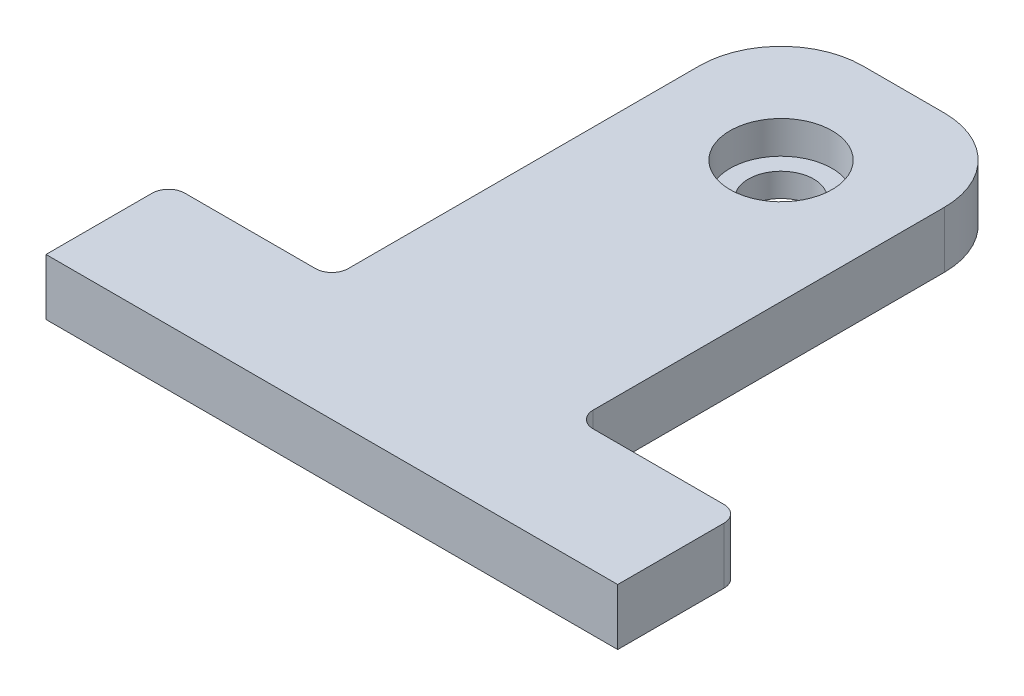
ISO-10303-21;
HEADER;
FILE_DESCRIPTION(('STEP AP214'),'2;1');
FILE_NAME('part.step','',(''),(''),'','','');
FILE_SCHEMA(('AUTOMOTIVE_DESIGN { 1 0 10303 214 1 1 1 1 }'));
ENDSEC;
DATA;
#1=APPLICATION_CONTEXT('core data for automotive mechanical design processes');
#2=APPLICATION_PROTOCOL_DEFINITION('international standard','automotive_design',2000,#1);
#3=PRODUCT_CONTEXT('',#1,'mechanical');
#4=PRODUCT('Part','Part','',(#3));
#5=PRODUCT_RELATED_PRODUCT_CATEGORY('part','',(#4));
#6=PRODUCT_DEFINITION_FORMATION('','',#4);
#7=PRODUCT_DEFINITION_CONTEXT('part definition',#1,'design');
#8=PRODUCT_DEFINITION('design','',#6,#7);
#9=PRODUCT_DEFINITION_SHAPE('','',#8);
#10=(LENGTH_UNIT() NAMED_UNIT(*) SI_UNIT(.MILLI.,.METRE.));
#11=(NAMED_UNIT(*) PLANE_ANGLE_UNIT() SI_UNIT($,.RADIAN.));
#12=(NAMED_UNIT(*) SI_UNIT($,.STERADIAN.) SOLID_ANGLE_UNIT());
#13=UNCERTAINTY_MEASURE_WITH_UNIT(LENGTH_MEASURE(1.E-05),#10,'distance_accuracy_value','');
#14=(GEOMETRIC_REPRESENTATION_CONTEXT(3) GLOBAL_UNCERTAINTY_ASSIGNED_CONTEXT((#13)) GLOBAL_UNIT_ASSIGNED_CONTEXT((#10,
#11,#12)) REPRESENTATION_CONTEXT('',''));
#15=CARTESIAN_POINT('',(0.,0.,0.));
#16=DIRECTION('',(0.,0.,1.));
#17=DIRECTION('',(1.,0.,0.));
#18=AXIS2_PLACEMENT_3D('',#15,#16,#17);
#19=CARTESIAN_POINT('',(44.45,8.763,-69.85));
#20=DIRECTION('',(0.,-1.,0.));
#21=DIRECTION('',(0.,0.,-1.));
#22=AXIS2_PLACEMENT_3D('',#19,#20,#21);
#23=CYLINDRICAL_SURFACE('',#22,5.08000000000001);
#24=CARTESIAN_POINT('',(44.45,0.,-69.85));
#25=DIRECTION('',(0.,1.,0.));
#26=DIRECTION('',(0.,0.,1.));
#27=AXIS2_PLACEMENT_3D('',#24,#25,#26);
#28=CIRCLE('',#27,5.08000000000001);
#29=CARTESIAN_POINT('',(44.45,0.,-64.77));
#30=VERTEX_POINT('',#29);
#31=EDGE_CURVE('E170',#30,#30,#28,.T.);
#32=ORIENTED_EDGE('',*,*,#31,.F.);
#33=EDGE_LOOP('',(#32));
#34=FACE_BOUND('',#33,.T.);
#35=CARTESIAN_POINT('',(44.45,3.683,-69.85));
#36=DIRECTION('',(0.,1.,0.));
#37=DIRECTION('',(0.,0.,1.));
#38=AXIS2_PLACEMENT_3D('',#35,#36,#37);
#39=CIRCLE('',#38,5.08000000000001);
#40=CARTESIAN_POINT('',(44.45,3.683,-64.77));
#41=VERTEX_POINT('',#40);
#42=EDGE_CURVE('E36',#41,#41,#39,.T.);
#43=ORIENTED_EDGE('',*,*,#42,.T.);
#44=EDGE_LOOP('',(#43));
#45=FACE_BOUND('',#44,.T.);
#46=ADVANCED_FACE('F32',(#34,#45),#23,.F.);
#47=CARTESIAN_POINT('',(86.36,8.763,-16.51));
#48=DIRECTION('',(0.,1.,0.));
#49=DIRECTION('',(0.,0.,1.));
#50=AXIS2_PLACEMENT_3D('',#47,#48,#49);
#51=PLANE('',#50);
#52=CARTESIAN_POINT('',(44.45,8.763,-69.85));
#53=DIRECTION('',(0.,1.,0.));
#54=DIRECTION('',(0.,0.,1.));
#55=AXIS2_PLACEMENT_3D('',#52,#53,#54);
#56=CIRCLE('',#55,7.9375);
#57=CARTESIAN_POINT('',(44.45,8.763,-61.9125));
#58=VERTEX_POINT('',#57);
#59=EDGE_CURVE('E381',#58,#58,#56,.T.);
#60=ORIENTED_EDGE('',*,*,#59,.F.);
#61=EDGE_LOOP('',(#60));
#62=FACE_BOUND('',#61,.T.);
#63=DIRECTION('',(0.,0.,1.));
#64=VECTOR('',#63,1.);
#65=CARTESIAN_POINT('',(0.,8.763,-16.51));
#66=LINE('',#65,#64);
#67=CARTESIAN_POINT('',(0.,8.763,-16.51));
#68=VERTEX_POINT('',#67);
#69=CARTESIAN_POINT('',(0.,8.763,0.));
#70=VERTEX_POINT('',#69);
#71=EDGE_CURVE('E193',#68,#70,#66,.T.);
#72=ORIENTED_EDGE('',*,*,#71,.T.);
#73=DIRECTION('',(1.,0.,0.));
#74=VECTOR('',#73,1.);
#75=CARTESIAN_POINT('',(0.,8.763,0.));
#76=LINE('',#75,#74);
#77=CARTESIAN_POINT('',(88.9,8.763,0.));
#78=VERTEX_POINT('',#77);
#79=EDGE_CURVE('E111',#70,#78,#76,.T.);
#80=ORIENTED_EDGE('',*,*,#79,.T.);
#81=DIRECTION('',(0.,0.,-1.));
#82=VECTOR('',#81,1.);
#83=CARTESIAN_POINT('',(88.9,8.763,0.));
#84=LINE('',#83,#82);
#85=CARTESIAN_POINT('',(88.9,8.763,-16.51));
#86=VERTEX_POINT('',#85);
#87=EDGE_CURVE('E227',#78,#86,#84,.T.);
#88=ORIENTED_EDGE('',*,*,#87,.T.);
#89=CARTESIAN_POINT('',(86.36,8.763,-16.51));
#90=DIRECTION('',(0.,1.,0.));
#91=DIRECTION('',(0.,0.,1.));
#92=AXIS2_PLACEMENT_3D('',#89,#90,#91);
#93=CIRCLE('',#92,2.54);
#94=CARTESIAN_POINT('',(86.36,8.763,-19.05));
#95=VERTEX_POINT('',#94);
#96=EDGE_CURVE('E246',#86,#95,#93,.T.);
#97=ORIENTED_EDGE('',*,*,#96,.T.);
#98=DIRECTION('',(-1.,0.,0.));
#99=VECTOR('',#98,1.);
#100=CARTESIAN_POINT('',(86.36,8.763,-19.05));
#101=LINE('',#100,#99);
#102=CARTESIAN_POINT('',(66.04,8.763,-19.05));
#103=VERTEX_POINT('',#102);
#104=EDGE_CURVE('E243',#95,#103,#101,.T.);
#105=ORIENTED_EDGE('',*,*,#104,.T.);
#106=CARTESIAN_POINT('',(66.04,8.763,-21.59));
#107=DIRECTION('',(0.,-1.,0.));
#108=DIRECTION('',(0.,0.,-1.));
#109=AXIS2_PLACEMENT_3D('',#106,#107,#108);
#110=CIRCLE('',#109,2.54);
#111=CARTESIAN_POINT('',(63.5,8.763,-21.59));
#112=VERTEX_POINT('',#111);
#113=EDGE_CURVE('E245',#103,#112,#110,.T.);
#114=ORIENTED_EDGE('',*,*,#113,.T.);
#115=DIRECTION('',(0.,0.,-1.));
#116=VECTOR('',#115,1.);
#117=CARTESIAN_POINT('',(63.5,8.763,-21.59));
#118=LINE('',#117,#116);
#119=CARTESIAN_POINT('',(63.5,8.763,-76.1999999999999));
#120=VERTEX_POINT('',#119);
#121=EDGE_CURVE('E248',#112,#120,#118,.T.);
#122=ORIENTED_EDGE('',*,*,#121,.T.);
#123=CARTESIAN_POINT('',(50.8,8.763,-76.2));
#124=DIRECTION('',(0.,1.,0.));
#125=DIRECTION('',(0.,0.,1.));
#126=AXIS2_PLACEMENT_3D('',#123,#124,#125);
#127=CIRCLE('',#126,12.7);
#128=CARTESIAN_POINT('',(50.7999999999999,8.763,-88.9));
#129=VERTEX_POINT('',#128);
#130=EDGE_CURVE('E254',#120,#129,#127,.T.);
#131=ORIENTED_EDGE('',*,*,#130,.T.);
#132=DIRECTION('',(-1.,0.,0.));
#133=VECTOR('',#132,1.);
#134=CARTESIAN_POINT('',(50.7999999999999,8.763,-88.9));
#135=LINE('',#134,#133);
#136=CARTESIAN_POINT('',(38.1000000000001,8.763,-88.9));
#137=VERTEX_POINT('',#136);
#138=EDGE_CURVE('E256',#129,#137,#135,.T.);
#139=ORIENTED_EDGE('',*,*,#138,.T.);
#140=CARTESIAN_POINT('',(38.1,8.763,-76.2));
#141=DIRECTION('',(0.,1.,0.));
#142=DIRECTION('',(0.,0.,1.));
#143=AXIS2_PLACEMENT_3D('',#140,#141,#142);
#144=CIRCLE('',#143,12.7);
#145=CARTESIAN_POINT('',(25.4,8.763,-76.1999999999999));
#146=VERTEX_POINT('',#145);
#147=EDGE_CURVE('E258',#137,#146,#144,.T.);
#148=ORIENTED_EDGE('',*,*,#147,.T.);
#149=DIRECTION('',(0.,0.,1.));
#150=VECTOR('',#149,1.);
#151=CARTESIAN_POINT('',(25.4,8.763,-76.1999999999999));
#152=LINE('',#151,#150);
#153=CARTESIAN_POINT('',(25.4,8.763,-21.59));
#154=VERTEX_POINT('',#153);
#155=EDGE_CURVE('E148',#146,#154,#152,.T.);
#156=ORIENTED_EDGE('',*,*,#155,.T.);
#157=CARTESIAN_POINT('',(22.86,8.763,-21.59));
#158=DIRECTION('',(0.,-1.,0.));
#159=DIRECTION('',(0.,0.,-1.));
#160=AXIS2_PLACEMENT_3D('',#157,#158,#159);
#161=CIRCLE('',#160,2.54);
#162=CARTESIAN_POINT('',(22.86,8.763,-19.05));
#163=VERTEX_POINT('',#162);
#164=EDGE_CURVE('E142',#154,#163,#161,.T.);
#165=ORIENTED_EDGE('',*,*,#164,.T.);
#166=DIRECTION('',(-1.,0.,0.));
#167=VECTOR('',#166,1.);
#168=CARTESIAN_POINT('',(22.86,8.763,-19.05));
#169=LINE('',#168,#167);
#170=CARTESIAN_POINT('',(2.54000000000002,8.763,-19.05));
#171=VERTEX_POINT('',#170);
#172=EDGE_CURVE('E146',#163,#171,#169,.T.);
#173=ORIENTED_EDGE('',*,*,#172,.T.);
#174=CARTESIAN_POINT('',(2.54,8.763,-16.51));
#175=DIRECTION('',(0.,1.,0.));
#176=DIRECTION('',(0.,0.,1.));
#177=AXIS2_PLACEMENT_3D('',#174,#175,#176);
#178=CIRCLE('',#177,2.54);
#179=EDGE_CURVE('E50',#171,#68,#178,.T.);
#180=ORIENTED_EDGE('',*,*,#179,.T.);
#181=EDGE_LOOP('',(#72,#80,#88,#97,#105,#114,#122,#131,#139,#148,#156,#165,#173,#180));
#182=FACE_BOUND('',#181,.T.);
#183=ADVANCED_FACE('F144',(#62,#182),#51,.T.);
#184=CARTESIAN_POINT('',(86.36,0.,-16.51));
#185=DIRECTION('',(0.,1.,0.));
#186=DIRECTION('',(0.,0.,1.));
#187=AXIS2_PLACEMENT_3D('',#184,#185,#186);
#188=PLANE('',#187);
#189=DIRECTION('',(0.,0.,1.));
#190=VECTOR('',#189,1.);
#191=CARTESIAN_POINT('',(0.,0.,-16.51));
#192=LINE('',#191,#190);
#193=CARTESIAN_POINT('',(0.,0.,-16.51));
#194=VERTEX_POINT('',#193);
#195=CARTESIAN_POINT('',(0.,0.,0.));
#196=VERTEX_POINT('',#195);
#197=EDGE_CURVE('E166',#194,#196,#192,.T.);
#198=ORIENTED_EDGE('',*,*,#197,.F.);
#199=CARTESIAN_POINT('',(2.54,0.,-16.51));
#200=DIRECTION('',(0.,1.,0.));
#201=DIRECTION('',(0.,0.,1.));
#202=AXIS2_PLACEMENT_3D('',#199,#200,#201);
#203=CIRCLE('',#202,2.54);
#204=CARTESIAN_POINT('',(2.54000000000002,0.,-19.05));
#205=VERTEX_POINT('',#204);
#206=EDGE_CURVE('E103',#205,#194,#203,.T.);
#207=ORIENTED_EDGE('',*,*,#206,.F.);
#208=DIRECTION('',(-1.,0.,0.));
#209=VECTOR('',#208,1.);
#210=CARTESIAN_POINT('',(22.86,0.,-19.05));
#211=LINE('',#210,#209);
#212=CARTESIAN_POINT('',(22.86,0.,-19.05));
#213=VERTEX_POINT('',#212);
#214=EDGE_CURVE('E97',#213,#205,#211,.T.);
#215=ORIENTED_EDGE('',*,*,#214,.F.);
#216=CARTESIAN_POINT('',(22.86,0.,-21.59));
#217=DIRECTION('',(0.,-1.,0.));
#218=DIRECTION('',(0.,0.,-1.));
#219=AXIS2_PLACEMENT_3D('',#216,#217,#218);
#220=CIRCLE('',#219,2.54);
#221=CARTESIAN_POINT('',(25.4,0.,-21.59));
#222=VERTEX_POINT('',#221);
#223=EDGE_CURVE('E156',#222,#213,#220,.T.);
#224=ORIENTED_EDGE('',*,*,#223,.F.);
#225=DIRECTION('',(0.,0.,1.));
#226=VECTOR('',#225,1.);
#227=CARTESIAN_POINT('',(25.4,0.,-76.1999999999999));
#228=LINE('',#227,#226);
#229=CARTESIAN_POINT('',(25.4,0.,-76.1999999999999));
#230=VERTEX_POINT('',#229);
#231=EDGE_CURVE('E188',#230,#222,#228,.T.);
#232=ORIENTED_EDGE('',*,*,#231,.F.);
#233=CARTESIAN_POINT('',(38.1,0.,-76.2));
#234=DIRECTION('',(0.,1.,0.));
#235=DIRECTION('',(0.,0.,1.));
#236=AXIS2_PLACEMENT_3D('',#233,#234,#235);
#237=CIRCLE('',#236,12.7);
#238=CARTESIAN_POINT('',(38.1000000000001,0.,-88.9));
#239=VERTEX_POINT('',#238);
#240=EDGE_CURVE('E186',#239,#230,#237,.T.);
#241=ORIENTED_EDGE('',*,*,#240,.F.);
#242=DIRECTION('',(-1.,0.,0.));
#243=VECTOR('',#242,1.);
#244=CARTESIAN_POINT('',(50.7999999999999,0.,-88.9));
#245=LINE('',#244,#243);
#246=CARTESIAN_POINT('',(50.7999999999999,0.,-88.9));
#247=VERTEX_POINT('',#246);
#248=EDGE_CURVE('E184',#247,#239,#245,.T.);
#249=ORIENTED_EDGE('',*,*,#248,.F.);
#250=CARTESIAN_POINT('',(50.8,0.,-76.2));
#251=DIRECTION('',(0.,1.,0.));
#252=DIRECTION('',(0.,0.,1.));
#253=AXIS2_PLACEMENT_3D('',#250,#251,#252);
#254=CIRCLE('',#253,12.7);
#255=CARTESIAN_POINT('',(63.5,0.,-76.1999999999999));
#256=VERTEX_POINT('',#255);
#257=EDGE_CURVE('E182',#256,#247,#254,.T.);
#258=ORIENTED_EDGE('',*,*,#257,.F.);
#259=DIRECTION('',(0.,0.,-1.));
#260=VECTOR('',#259,1.);
#261=CARTESIAN_POINT('',(63.5,0.,-21.59));
#262=LINE('',#261,#260);
#263=CARTESIAN_POINT('',(63.5,0.,-21.59));
#264=VERTEX_POINT('',#263);
#265=EDGE_CURVE('E180',#264,#256,#262,.T.);
#266=ORIENTED_EDGE('',*,*,#265,.F.);
#267=CARTESIAN_POINT('',(66.04,0.,-21.59));
#268=DIRECTION('',(0.,-1.,0.));
#269=DIRECTION('',(0.,0.,-1.));
#270=AXIS2_PLACEMENT_3D('',#267,#268,#269);
#271=CIRCLE('',#270,2.54);
#272=CARTESIAN_POINT('',(66.04,0.,-19.05));
#273=VERTEX_POINT('',#272);
#274=EDGE_CURVE('E178',#273,#264,#271,.T.);
#275=ORIENTED_EDGE('',*,*,#274,.F.);
#276=DIRECTION('',(-1.,0.,0.));
#277=VECTOR('',#276,1.);
#278=CARTESIAN_POINT('',(86.36,0.,-19.05));
#279=LINE('',#278,#277);
#280=CARTESIAN_POINT('',(86.36,0.,-19.05));
#281=VERTEX_POINT('',#280);
#282=EDGE_CURVE('E176',#281,#273,#279,.T.);
#283=ORIENTED_EDGE('',*,*,#282,.F.);
#284=CARTESIAN_POINT('',(86.36,0.,-16.51));
#285=DIRECTION('',(0.,1.,0.));
#286=DIRECTION('',(0.,0.,1.));
#287=AXIS2_PLACEMENT_3D('',#284,#285,#286);
#288=CIRCLE('',#287,2.54);
#289=CARTESIAN_POINT('',(88.9,0.,-16.51));
#290=VERTEX_POINT('',#289);
#291=EDGE_CURVE('E174',#290,#281,#288,.T.);
#292=ORIENTED_EDGE('',*,*,#291,.F.);
#293=DIRECTION('',(0.,0.,-1.));
#294=VECTOR('',#293,1.);
#295=CARTESIAN_POINT('',(88.9,0.,0.));
#296=LINE('',#295,#294);
#297=CARTESIAN_POINT('',(88.9,0.,0.));
#298=VERTEX_POINT('',#297);
#299=EDGE_CURVE('E172',#298,#290,#296,.T.);
#300=ORIENTED_EDGE('',*,*,#299,.F.);
#301=DIRECTION('',(1.,0.,0.));
#302=VECTOR('',#301,1.);
#303=CARTESIAN_POINT('',(0.,0.,0.));
#304=LINE('',#303,#302);
#305=EDGE_CURVE('E169',#196,#298,#304,.T.);
#306=ORIENTED_EDGE('',*,*,#305,.F.);
#307=EDGE_LOOP('',(#198,#207,#215,#224,#232,#241,#249,#258,#266,#275,#283,#292,#300,#306));
#308=FACE_BOUND('',#307,.T.);
#309=ORIENTED_EDGE('',*,*,#31,.T.);
#310=EDGE_LOOP('',(#309));
#311=FACE_BOUND('',#310,.T.);
#312=ADVANCED_FACE('F231',(#308,#311),#188,.F.);
#313=CARTESIAN_POINT('',(0.,8.763,-16.51));
#314=DIRECTION('',(1.,0.,0.));
#315=DIRECTION('',(0.,0.,-1.));
#316=AXIS2_PLACEMENT_3D('',#313,#314,#315);
#317=PLANE('',#316);
#318=ORIENTED_EDGE('',*,*,#197,.T.);
#319=DIRECTION('',(0.,-1.,0.));
#320=VECTOR('',#319,1.);
#321=CARTESIAN_POINT('',(0.,8.763,0.));
#322=LINE('',#321,#320);
#323=EDGE_CURVE('E11',#70,#196,#322,.T.);
#324=ORIENTED_EDGE('',*,*,#323,.F.);
#325=ORIENTED_EDGE('',*,*,#71,.F.);
#326=DIRECTION('',(0.,-1.,0.));
#327=VECTOR('',#326,1.);
#328=CARTESIAN_POINT('',(0.,8.763,-16.51));
#329=LINE('',#328,#327);
#330=EDGE_CURVE('E162',#68,#194,#329,.T.);
#331=ORIENTED_EDGE('',*,*,#330,.T.);
#332=EDGE_LOOP('',(#318,#324,#325,#331));
#333=FACE_BOUND('',#332,.T.);
#334=ADVANCED_FACE('F34',(#333),#317,.F.);
#335=CARTESIAN_POINT('',(0.,8.763,0.));
#336=DIRECTION('',(0.,0.,-1.));
#337=DIRECTION('',(-1.,0.,0.));
#338=AXIS2_PLACEMENT_3D('',#335,#336,#337);
#339=PLANE('',#338);
#340=ORIENTED_EDGE('',*,*,#305,.T.);
#341=DIRECTION('',(0.,-1.,0.));
#342=VECTOR('',#341,1.);
#343=CARTESIAN_POINT('',(88.9,8.763,0.));
#344=LINE('',#343,#342);
#345=EDGE_CURVE('E42',#78,#298,#344,.T.);
#346=ORIENTED_EDGE('',*,*,#345,.F.);
#347=ORIENTED_EDGE('',*,*,#79,.F.);
#348=ORIENTED_EDGE('',*,*,#323,.T.);
#349=EDGE_LOOP('',(#340,#346,#347,#348));
#350=FACE_BOUND('',#349,.T.);
#351=ADVANCED_FACE('F300',(#350),#339,.F.);
#352=CARTESIAN_POINT('',(88.9,8.763,0.));
#353=DIRECTION('',(-1.,0.,0.));
#354=DIRECTION('',(0.,0.,1.));
#355=AXIS2_PLACEMENT_3D('',#352,#353,#354);
#356=PLANE('',#355);
#357=ORIENTED_EDGE('',*,*,#299,.T.);
#358=DIRECTION('',(0.,-1.,0.));
#359=VECTOR('',#358,1.);
#360=CARTESIAN_POINT('',(88.9,8.763,-16.51));
#361=LINE('',#360,#359);
#362=EDGE_CURVE('E218',#86,#290,#361,.T.);
#363=ORIENTED_EDGE('',*,*,#362,.F.);
#364=ORIENTED_EDGE('',*,*,#87,.F.);
#365=ORIENTED_EDGE('',*,*,#345,.T.);
#366=EDGE_LOOP('',(#357,#363,#364,#365));
#367=FACE_BOUND('',#366,.T.);
#368=ADVANCED_FACE('F225',(#367),#356,.F.);
#369=CARTESIAN_POINT('',(86.36,8.763,-16.51));
#370=DIRECTION('',(0.,-1.,0.));
#371=DIRECTION('',(0.,0.,-1.));
#372=AXIS2_PLACEMENT_3D('',#369,#370,#371);
#373=CYLINDRICAL_SURFACE('',#372,2.54);
#374=ORIENTED_EDGE('',*,*,#291,.T.);
#375=DIRECTION('',(0.,-1.,0.));
#376=VECTOR('',#375,1.);
#377=CARTESIAN_POINT('',(86.36,8.763,-19.05));
#378=LINE('',#377,#376);
#379=EDGE_CURVE('E215',#95,#281,#378,.T.);
#380=ORIENTED_EDGE('',*,*,#379,.F.);
#381=ORIENTED_EDGE('',*,*,#96,.F.);
#382=ORIENTED_EDGE('',*,*,#362,.T.);
#383=EDGE_LOOP('',(#374,#380,#381,#382));
#384=FACE_BOUND('',#383,.T.);
#385=ADVANCED_FACE('F237',(#384),#373,.T.);
#386=CARTESIAN_POINT('',(86.36,8.763,-19.05));
#387=DIRECTION('',(0.,0.,1.));
#388=DIRECTION('',(1.,0.,0.));
#389=AXIS2_PLACEMENT_3D('',#386,#387,#388);
#390=PLANE('',#389);
#391=ORIENTED_EDGE('',*,*,#282,.T.);
#392=DIRECTION('',(0.,-1.,0.));
#393=VECTOR('',#392,1.);
#394=CARTESIAN_POINT('',(66.04,8.763,-19.05));
#395=LINE('',#394,#393);
#396=EDGE_CURVE('E212',#103,#273,#395,.T.);
#397=ORIENTED_EDGE('',*,*,#396,.F.);
#398=ORIENTED_EDGE('',*,*,#104,.F.);
#399=ORIENTED_EDGE('',*,*,#379,.T.);
#400=EDGE_LOOP('',(#391,#397,#398,#399));
#401=FACE_BOUND('',#400,.T.);
#402=ADVANCED_FACE('F241',(#401),#390,.F.);
#403=CARTESIAN_POINT('',(66.04,8.763,-21.59));
#404=DIRECTION('',(0.,-1.,0.));
#405=DIRECTION('',(0.,0.,-1.));
#406=AXIS2_PLACEMENT_3D('',#403,#404,#405);
#407=CYLINDRICAL_SURFACE('',#406,2.54);
#408=ORIENTED_EDGE('',*,*,#274,.T.);
#409=DIRECTION('',(0.,-1.,0.));
#410=VECTOR('',#409,1.);
#411=CARTESIAN_POINT('',(63.5,8.763,-21.59));
#412=LINE('',#411,#410);
#413=EDGE_CURVE('E209',#112,#264,#412,.T.);
#414=ORIENTED_EDGE('',*,*,#413,.F.);
#415=ORIENTED_EDGE('',*,*,#113,.F.);
#416=ORIENTED_EDGE('',*,*,#396,.T.);
#417=EDGE_LOOP('',(#408,#414,#415,#416));
#418=FACE_BOUND('',#417,.T.);
#419=ADVANCED_FACE('F313',(#418),#407,.F.);
#420=CARTESIAN_POINT('',(63.5,8.763,-21.59));
#421=DIRECTION('',(-1.,0.,0.));
#422=DIRECTION('',(0.,0.,1.));
#423=AXIS2_PLACEMENT_3D('',#420,#421,#422);
#424=PLANE('',#423);
#425=ORIENTED_EDGE('',*,*,#265,.T.);
#426=DIRECTION('',(0.,-1.,0.));
#427=VECTOR('',#426,1.);
#428=CARTESIAN_POINT('',(63.5,8.763,-76.1999999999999));
#429=LINE('',#428,#427);
#430=EDGE_CURVE('E206',#120,#256,#429,.T.);
#431=ORIENTED_EDGE('',*,*,#430,.F.);
#432=ORIENTED_EDGE('',*,*,#121,.F.);
#433=ORIENTED_EDGE('',*,*,#413,.T.);
#434=EDGE_LOOP('',(#425,#431,#432,#433));
#435=FACE_BOUND('',#434,.T.);
#436=ADVANCED_FACE('F316',(#435),#424,.F.);
#437=CARTESIAN_POINT('',(50.8,8.763,-76.2));
#438=DIRECTION('',(0.,-1.,0.));
#439=DIRECTION('',(0.,0.,-1.));
#440=AXIS2_PLACEMENT_3D('',#437,#438,#439);
#441=CYLINDRICAL_SURFACE('',#440,12.7);
#442=ORIENTED_EDGE('',*,*,#257,.T.);
#443=DIRECTION('',(0.,-1.,0.));
#444=VECTOR('',#443,1.);
#445=CARTESIAN_POINT('',(50.7999999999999,8.763,-88.9));
#446=LINE('',#445,#444);
#447=EDGE_CURVE('E203',#129,#247,#446,.T.);
#448=ORIENTED_EDGE('',*,*,#447,.F.);
#449=ORIENTED_EDGE('',*,*,#130,.F.);
#450=ORIENTED_EDGE('',*,*,#430,.T.);
#451=EDGE_LOOP('',(#442,#448,#449,#450));
#452=FACE_BOUND('',#451,.T.);
#453=ADVANCED_FACE('F320',(#452),#441,.T.);
#454=CARTESIAN_POINT('',(50.7999999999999,8.763,-88.9));
#455=DIRECTION('',(0.,0.,1.));
#456=DIRECTION('',(1.,0.,0.));
#457=AXIS2_PLACEMENT_3D('',#454,#455,#456);
#458=PLANE('',#457);
#459=ORIENTED_EDGE('',*,*,#248,.T.);
#460=DIRECTION('',(0.,-1.,0.));
#461=VECTOR('',#460,1.);
#462=CARTESIAN_POINT('',(38.1000000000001,8.763,-88.9));
#463=LINE('',#462,#461);
#464=EDGE_CURVE('E200',#137,#239,#463,.T.);
#465=ORIENTED_EDGE('',*,*,#464,.F.);
#466=ORIENTED_EDGE('',*,*,#138,.F.);
#467=ORIENTED_EDGE('',*,*,#447,.T.);
#468=EDGE_LOOP('',(#459,#465,#466,#467));
#469=FACE_BOUND('',#468,.T.);
#470=ADVANCED_FACE('F324',(#469),#458,.F.);
#471=CARTESIAN_POINT('',(38.1,8.763,-76.2));
#472=DIRECTION('',(0.,-1.,0.));
#473=DIRECTION('',(0.,0.,-1.));
#474=AXIS2_PLACEMENT_3D('',#471,#472,#473);
#475=CYLINDRICAL_SURFACE('',#474,12.7);
#476=ORIENTED_EDGE('',*,*,#240,.T.);
#477=DIRECTION('',(0.,-1.,0.));
#478=VECTOR('',#477,1.);
#479=CARTESIAN_POINT('',(25.4,8.763,-76.1999999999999));
#480=LINE('',#479,#478);
#481=EDGE_CURVE('E197',#146,#230,#480,.T.);
#482=ORIENTED_EDGE('',*,*,#481,.F.);
#483=ORIENTED_EDGE('',*,*,#147,.F.);
#484=ORIENTED_EDGE('',*,*,#464,.T.);
#485=EDGE_LOOP('',(#476,#482,#483,#484));
#486=FACE_BOUND('',#485,.T.);
#487=ADVANCED_FACE('F264',(#486),#475,.T.);
#488=CARTESIAN_POINT('',(25.4,8.763,-76.1999999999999));
#489=DIRECTION('',(1.,0.,0.));
#490=DIRECTION('',(0.,0.,-1.));
#491=AXIS2_PLACEMENT_3D('',#488,#489,#490);
#492=PLANE('',#491);
#493=ORIENTED_EDGE('',*,*,#231,.T.);
#494=DIRECTION('',(0.,-1.,0.));
#495=VECTOR('',#494,1.);
#496=CARTESIAN_POINT('',(25.4,8.763,-21.59));
#497=LINE('',#496,#495);
#498=EDGE_CURVE('E157',#154,#222,#497,.T.);
#499=ORIENTED_EDGE('',*,*,#498,.F.);
#500=ORIENTED_EDGE('',*,*,#155,.F.);
#501=ORIENTED_EDGE('',*,*,#481,.T.);
#502=EDGE_LOOP('',(#493,#499,#500,#501));
#503=FACE_BOUND('',#502,.T.);
#504=ADVANCED_FACE('F268',(#503),#492,.F.);
#505=CARTESIAN_POINT('',(22.86,8.763,-21.59));
#506=DIRECTION('',(0.,-1.,0.));
#507=DIRECTION('',(0.,0.,-1.));
#508=AXIS2_PLACEMENT_3D('',#505,#506,#507);
#509=CYLINDRICAL_SURFACE('',#508,2.54);
#510=ORIENTED_EDGE('',*,*,#223,.T.);
#511=DIRECTION('',(0.,-1.,0.));
#512=VECTOR('',#511,1.);
#513=CARTESIAN_POINT('',(22.86,8.763,-19.05));
#514=LINE('',#513,#512);
#515=EDGE_CURVE('E153',#163,#213,#514,.T.);
#516=ORIENTED_EDGE('',*,*,#515,.F.);
#517=ORIENTED_EDGE('',*,*,#164,.F.);
#518=ORIENTED_EDGE('',*,*,#498,.T.);
#519=EDGE_LOOP('',(#510,#516,#517,#518));
#520=FACE_BOUND('',#519,.T.);
#521=ADVANCED_FACE('F154',(#520),#509,.F.);
#522=CARTESIAN_POINT('',(22.86,8.763,-19.05));
#523=DIRECTION('',(0.,0.,1.));
#524=DIRECTION('',(1.,0.,0.));
#525=AXIS2_PLACEMENT_3D('',#522,#523,#524);
#526=PLANE('',#525);
#527=ORIENTED_EDGE('',*,*,#214,.T.);
#528=DIRECTION('',(0.,-1.,0.));
#529=VECTOR('',#528,1.);
#530=CARTESIAN_POINT('',(2.54000000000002,8.763,-19.05));
#531=LINE('',#530,#529);
#532=EDGE_CURVE('E158',#171,#205,#531,.T.);
#533=ORIENTED_EDGE('',*,*,#532,.F.);
#534=ORIENTED_EDGE('',*,*,#172,.F.);
#535=ORIENTED_EDGE('',*,*,#515,.T.);
#536=EDGE_LOOP('',(#527,#533,#534,#535));
#537=FACE_BOUND('',#536,.T.);
#538=ADVANCED_FACE('F160',(#537),#526,.F.);
#539=CARTESIAN_POINT('',(2.54,8.763,-16.51));
#540=DIRECTION('',(0.,-1.,0.));
#541=DIRECTION('',(0.,0.,-1.));
#542=AXIS2_PLACEMENT_3D('',#539,#540,#541);
#543=CYLINDRICAL_SURFACE('',#542,2.54);
#544=ORIENTED_EDGE('',*,*,#206,.T.);
#545=ORIENTED_EDGE('',*,*,#330,.F.);
#546=ORIENTED_EDGE('',*,*,#179,.F.);
#547=ORIENTED_EDGE('',*,*,#532,.T.);
#548=EDGE_LOOP('',(#544,#545,#546,#547));
#549=FACE_BOUND('',#548,.T.);
#550=ADVANCED_FACE('F272',(#549),#543,.T.);
#551=CARTESIAN_POINT('',(44.45,3.683,-69.85));
#552=DIRECTION('',(0.,1.,0.));
#553=DIRECTION('',(0.,0.,1.));
#554=AXIS2_PLACEMENT_3D('',#551,#552,#553);
#555=CYLINDRICAL_SURFACE('',#554,7.9375);
#556=CARTESIAN_POINT('',(44.45,3.683,-69.85));
#557=DIRECTION('',(0.,1.,0.));
#558=DIRECTION('',(0.,0.,1.));
#559=AXIS2_PLACEMENT_3D('',#556,#557,#558);
#560=CIRCLE('',#559,7.9375);
#561=CARTESIAN_POINT('',(44.45,3.683,-61.9125));
#562=VERTEX_POINT('',#561);
#563=EDGE_CURVE('E380',#562,#562,#560,.T.);
#564=ORIENTED_EDGE('',*,*,#563,.F.);
#565=EDGE_LOOP('',(#564));
#566=FACE_BOUND('',#565,.T.);
#567=ORIENTED_EDGE('',*,*,#59,.T.);
#568=EDGE_LOOP('',(#567));
#569=FACE_BOUND('',#568,.T.);
#570=ADVANCED_FACE('F274',(#566,#569),#555,.F.);
#571=CARTESIAN_POINT('',(44.45,3.683,-69.85));
#572=DIRECTION('',(0.,1.,0.));
#573=DIRECTION('',(0.,0.,1.));
#574=AXIS2_PLACEMENT_3D('',#571,#572,#573);
#575=PLANE('',#574);
#576=ORIENTED_EDGE('',*,*,#42,.F.);
#577=EDGE_LOOP('',(#576));
#578=FACE_BOUND('',#577,.T.);
#579=ORIENTED_EDGE('',*,*,#563,.T.);
#580=EDGE_LOOP('',(#579));
#581=FACE_BOUND('',#580,.T.);
#582=ADVANCED_FACE('F280',(#578,#581),#575,.T.);
#583=CLOSED_SHELL('',(#46,#183,#312,#334,#351,#368,#385,#402,#419,#436,#453,#470,#487,#504,#521,
#538,#550,#570,#582));
#584=MANIFOLD_SOLID_BREP('B2',#583);
#585=ADVANCED_BREP_SHAPE_REPRESENTATION('',(#18,#584),#14);
#586=SHAPE_DEFINITION_REPRESENTATION(#9,#585);
ENDSEC;
END-ISO-10303-21;
